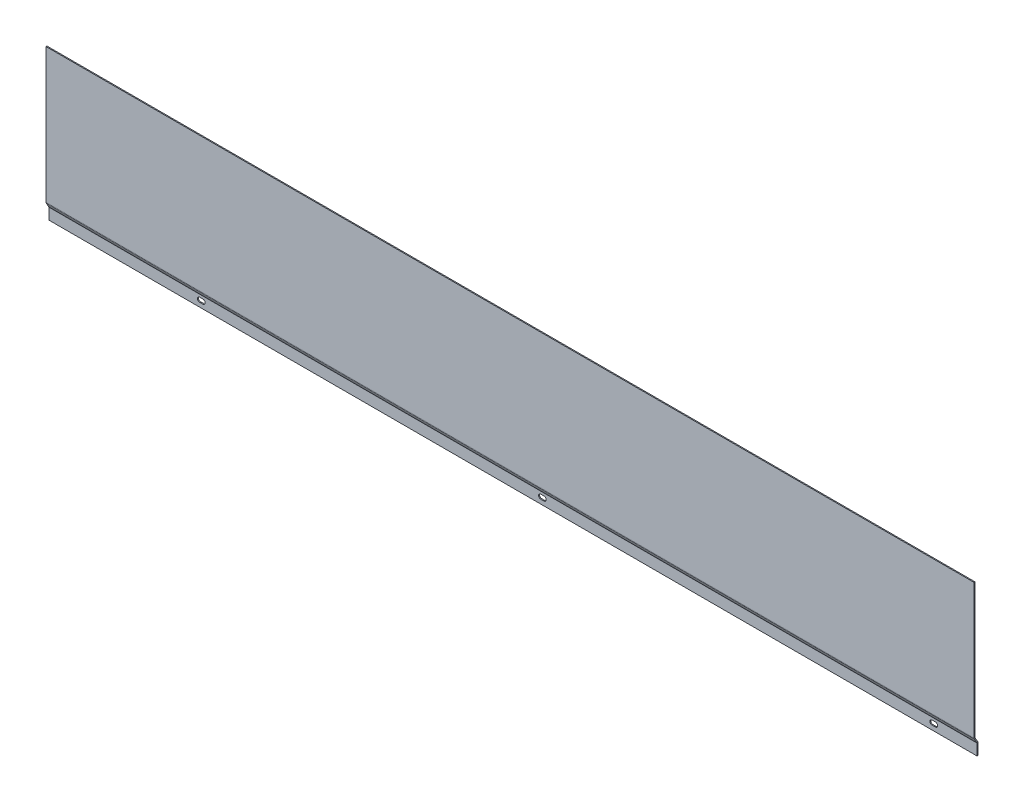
ISO-10303-21;
HEADER;
FILE_DESCRIPTION(('STEP AP214'),'2;1');
FILE_NAME('part.step','',(''),(''),'','','');
FILE_SCHEMA(('AUTOMOTIVE_DESIGN { 1 0 10303 214 1 1 1 1 }'));
ENDSEC;
DATA;
#1=APPLICATION_CONTEXT('core data for automotive mechanical design processes');
#2=APPLICATION_PROTOCOL_DEFINITION('international standard','automotive_design',2000,#1);
#3=PRODUCT_CONTEXT('',#1,'mechanical');
#4=PRODUCT('Part','Part','',(#3));
#5=PRODUCT_RELATED_PRODUCT_CATEGORY('part','',(#4));
#6=PRODUCT_DEFINITION_FORMATION('','',#4);
#7=PRODUCT_DEFINITION_CONTEXT('part definition',#1,'design');
#8=PRODUCT_DEFINITION('design','',#6,#7);
#9=PRODUCT_DEFINITION_SHAPE('','',#8);
#10=(LENGTH_UNIT() NAMED_UNIT(*) SI_UNIT(.MILLI.,.METRE.));
#11=(NAMED_UNIT(*) PLANE_ANGLE_UNIT() SI_UNIT($,.RADIAN.));
#12=(NAMED_UNIT(*) SI_UNIT($,.STERADIAN.) SOLID_ANGLE_UNIT());
#13=UNCERTAINTY_MEASURE_WITH_UNIT(LENGTH_MEASURE(1.E-05),#10,'distance_accuracy_value','');
#14=(GEOMETRIC_REPRESENTATION_CONTEXT(3) GLOBAL_UNCERTAINTY_ASSIGNED_CONTEXT((#13)) GLOBAL_UNIT_ASSIGNED_CONTEXT((#10,
#11,#12)) REPRESENTATION_CONTEXT('',''));
#15=CARTESIAN_POINT('',(0.,0.,0.));
#16=DIRECTION('',(0.,0.,1.));
#17=DIRECTION('',(1.,0.,0.));
#18=AXIS2_PLACEMENT_3D('',#15,#16,#17);
#19=CARTESIAN_POINT('',(1437.,17.1961524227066,0.));
#20=DIRECTION('',(1.,0.,0.));
#21=DIRECTION('',(0.,0.,-1.));
#22=AXIS2_PLACEMENT_3D('',#19,#20,#21);
#23=PLANE('',#22);
#24=DIRECTION('',(0.,0.,1.));
#25=VECTOR('',#24,1.);
#26=CARTESIAN_POINT('',(1437.,17.1961524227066,0.));
#27=LINE('',#26,#25);
#28=CARTESIAN_POINT('',(1437.,17.1961524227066,0.));
#29=VERTEX_POINT('',#28);
#30=CARTESIAN_POINT('',(1437.,17.1961524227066,1.5));
#31=VERTEX_POINT('',#30);
#32=EDGE_CURVE('E11',#29,#31,#27,.T.);
#33=ORIENTED_EDGE('',*,*,#32,.F.);
#34=CARTESIAN_POINT('',(1437.,17.1961524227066,3.));
#35=DIRECTION('',(-1.,0.,0.));
#36=DIRECTION('',(0.,0.,1.));
#37=AXIS2_PLACEMENT_3D('',#34,#35,#36);
#38=CIRCLE('',#37,3.);
#39=CARTESIAN_POINT('',(1437.,18.6961524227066,0.401923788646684));
#40=VERTEX_POINT('',#39);
#41=EDGE_CURVE('E416',#29,#40,#38,.F.);
#42=ORIENTED_EDGE('',*,*,#41,.T.);
#43=DIRECTION('',(0.,0.5,-0.866025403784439));
#44=VECTOR('',#43,1.);
#45=CARTESIAN_POINT('',(1437.,17.9461524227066,1.70096189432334));
#46=LINE('',#45,#44);
#47=CARTESIAN_POINT('',(1437.,17.9461524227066,1.70096189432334));
#48=VERTEX_POINT('',#47);
#49=EDGE_CURVE('E46',#48,#40,#46,.T.);
#50=ORIENTED_EDGE('',*,*,#49,.F.);
#51=CARTESIAN_POINT('',(1437.,17.1961524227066,3.));
#52=DIRECTION('',(1.,0.,0.));
#53=DIRECTION('',(0.,0.,-1.));
#54=AXIS2_PLACEMENT_3D('',#51,#52,#53);
#55=CIRCLE('',#54,1.5);
#56=EDGE_CURVE('E400',#31,#48,#55,.T.);
#57=ORIENTED_EDGE('',*,*,#56,.F.);
#58=EDGE_LOOP('',(#33,#42,#50,#57));
#59=FACE_BOUND('',#58,.T.);
#60=ADVANCED_FACE('F38',(#59),#23,.T.);
#61=CARTESIAN_POINT('',(1437.,17.9461524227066,1.70096189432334));
#62=DIRECTION('',(1.,0.,0.));
#63=DIRECTION('',(0.,0.,-1.));
#64=AXIS2_PLACEMENT_3D('',#61,#62,#63);
#65=PLANE('',#64);
#66=DIRECTION('',(0.,1.,0.));
#67=VECTOR('',#66,1.);
#68=CARTESIAN_POINT('',(1437.,0.,0.));
#69=LINE('',#68,#67);
#70=CARTESIAN_POINT('',(1437.,0.,0.));
#71=VERTEX_POINT('',#70);
#72=EDGE_CURVE('E412',#71,#29,#69,.T.);
#73=ORIENTED_EDGE('',*,*,#72,.T.);
#74=ORIENTED_EDGE('',*,*,#32,.T.);
#75=DIRECTION('',(0.,1.,0.));
#76=VECTOR('',#75,1.);
#77=CARTESIAN_POINT('',(1437.,0.,1.5));
#78=LINE('',#77,#76);
#79=CARTESIAN_POINT('',(1437.,0.,1.5));
#80=VERTEX_POINT('',#79);
#81=EDGE_CURVE('E404',#80,#31,#78,.T.);
#82=ORIENTED_EDGE('',*,*,#81,.F.);
#83=DIRECTION('',(0.,0.,1.));
#84=VECTOR('',#83,1.);
#85=CARTESIAN_POINT('',(1437.,0.,0.));
#86=LINE('',#85,#84);
#87=EDGE_CURVE('E408',#71,#80,#86,.T.);
#88=ORIENTED_EDGE('',*,*,#87,.F.);
#89=EDGE_LOOP('',(#73,#74,#82,#88));
#90=FACE_BOUND('',#89,.T.);
#91=ADVANCED_FACE('F532',(#90),#65,.T.);
#92=CARTESIAN_POINT('',(0.,18.6961524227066,0.401923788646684));
#93=DIRECTION('',(-1.,0.,0.));
#94=DIRECTION('',(0.,0.,1.));
#95=AXIS2_PLACEMENT_3D('',#92,#93,#94);
#96=PLANE('',#95);
#97=DIRECTION('',(0.,-0.5,0.866025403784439));
#98=VECTOR('',#97,1.);
#99=CARTESIAN_POINT('',(0.,18.6961524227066,0.401923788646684));
#100=LINE('',#99,#98);
#101=CARTESIAN_POINT('',(0.,18.6961524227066,0.401923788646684));
#102=VERTEX_POINT('',#101);
#103=CARTESIAN_POINT('',(0.,17.9461524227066,1.70096189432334));
#104=VERTEX_POINT('',#103);
#105=EDGE_CURVE('E487',#102,#104,#100,.T.);
#106=ORIENTED_EDGE('',*,*,#105,.F.);
#107=CARTESIAN_POINT('',(0.,17.1961524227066,3.));
#108=DIRECTION('',(-1.,0.,0.));
#109=DIRECTION('',(0.,0.,1.));
#110=AXIS2_PLACEMENT_3D('',#107,#108,#109);
#111=CIRCLE('',#110,3.);
#112=CARTESIAN_POINT('',(0.,17.1961524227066,0.));
#113=VERTEX_POINT('',#112);
#114=EDGE_CURVE('E369',#113,#102,#111,.F.);
#115=ORIENTED_EDGE('',*,*,#114,.F.);
#116=DIRECTION('',(0.,0.,-1.));
#117=VECTOR('',#116,1.);
#118=CARTESIAN_POINT('',(0.,17.1961524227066,1.5));
#119=LINE('',#118,#117);
#120=CARTESIAN_POINT('',(0.,17.1961524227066,1.5));
#121=VERTEX_POINT('',#120);
#122=EDGE_CURVE('E484',#121,#113,#119,.T.);
#123=ORIENTED_EDGE('',*,*,#122,.F.);
#124=CARTESIAN_POINT('',(0.,17.1961524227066,3.));
#125=DIRECTION('',(1.,0.,0.));
#126=DIRECTION('',(0.,0.,-1.));
#127=AXIS2_PLACEMENT_3D('',#124,#125,#126);
#128=CIRCLE('',#127,1.5);
#129=EDGE_CURVE('E353',#121,#104,#128,.T.);
#130=ORIENTED_EDGE('',*,*,#129,.T.);
#131=EDGE_LOOP('',(#106,#115,#123,#130));
#132=FACE_BOUND('',#131,.T.);
#133=ADVANCED_FACE('F542',(#132),#96,.T.);
#134=CARTESIAN_POINT('',(0.,17.1961524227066,1.5));
#135=DIRECTION('',(-1.,0.,0.));
#136=DIRECTION('',(0.,0.,1.));
#137=AXIS2_PLACEMENT_3D('',#134,#135,#136);
#138=PLANE('',#137);
#139=DIRECTION('',(0.,0.866025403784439,0.5));
#140=VECTOR('',#139,1.);
#141=CARTESIAN_POINT('',(0.,18.,0.));
#142=LINE('',#141,#140);
#143=CARTESIAN_POINT('',(0.,25.4461524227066,4.29903810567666));
#144=VERTEX_POINT('',#143);
#145=EDGE_CURVE('E373',#102,#144,#142,.T.);
#146=ORIENTED_EDGE('',*,*,#145,.F.);
#147=ORIENTED_EDGE('',*,*,#105,.T.);
#148=DIRECTION('',(0.,0.866025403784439,0.5));
#149=VECTOR('',#148,1.);
#150=CARTESIAN_POINT('',(0.,17.25,1.29903810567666));
#151=LINE('',#150,#149);
#152=CARTESIAN_POINT('',(0.,24.6961524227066,5.59807621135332));
#153=VERTEX_POINT('',#152);
#154=EDGE_CURVE('E349',#104,#153,#151,.T.);
#155=ORIENTED_EDGE('',*,*,#154,.T.);
#156=DIRECTION('',(0.,0.5,-0.866025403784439));
#157=VECTOR('',#156,1.);
#158=CARTESIAN_POINT('',(0.,24.6961524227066,5.59807621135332));
#159=LINE('',#158,#157);
#160=EDGE_CURVE('E472',#153,#144,#159,.T.);
#161=ORIENTED_EDGE('',*,*,#160,.T.);
#162=EDGE_LOOP('',(#146,#147,#155,#161));
#163=FACE_BOUND('',#162,.T.);
#164=ADVANCED_FACE('F544',(#163),#138,.T.);
#165=CARTESIAN_POINT('',(1437.,25.4461524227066,4.29903810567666));
#166=DIRECTION('',(1.,0.,0.));
#167=DIRECTION('',(0.,0.,-1.));
#168=AXIS2_PLACEMENT_3D('',#165,#166,#167);
#169=PLANE('',#168);
#170=DIRECTION('',(0.,-0.5,0.866025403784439));
#171=VECTOR('',#170,1.);
#172=CARTESIAN_POINT('',(1437.,25.4461524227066,4.29903810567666));
#173=LINE('',#172,#171);
#174=CARTESIAN_POINT('',(1437.,25.4461524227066,4.29903810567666));
#175=VERTEX_POINT('',#174);
#176=CARTESIAN_POINT('',(1437.,24.6961524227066,5.59807621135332));
#177=VERTEX_POINT('',#176);
#178=EDGE_CURVE('E481',#175,#177,#173,.T.);
#179=ORIENTED_EDGE('',*,*,#178,.F.);
#180=CARTESIAN_POINT('',(1437.,26.1961524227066,3.));
#181=DIRECTION('',(1.,0.,0.));
#182=DIRECTION('',(0.,0.,-1.));
#183=AXIS2_PLACEMENT_3D('',#180,#181,#182);
#184=CIRCLE('',#183,1.5);
#185=CARTESIAN_POINT('',(1437.,26.1961524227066,4.5));
#186=VERTEX_POINT('',#185);
#187=EDGE_CURVE('E424',#175,#186,#184,.F.);
#188=ORIENTED_EDGE('',*,*,#187,.T.);
#189=DIRECTION('',(0.,0.,-1.));
#190=VECTOR('',#189,1.);
#191=CARTESIAN_POINT('',(1437.,26.1961524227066,6.));
#192=LINE('',#191,#190);
#193=CARTESIAN_POINT('',(1437.,26.1961524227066,6.));
#194=VERTEX_POINT('',#193);
#195=EDGE_CURVE('E478',#194,#186,#192,.T.);
#196=ORIENTED_EDGE('',*,*,#195,.F.);
#197=CARTESIAN_POINT('',(1437.,26.1961524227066,3.));
#198=DIRECTION('',(1.,0.,0.));
#199=DIRECTION('',(0.,0.,-1.));
#200=AXIS2_PLACEMENT_3D('',#197,#198,#199);
#201=CIRCLE('',#200,3.);
#202=EDGE_CURVE('E392',#177,#194,#201,.F.);
#203=ORIENTED_EDGE('',*,*,#202,.F.);
#204=EDGE_LOOP('',(#179,#188,#196,#203));
#205=FACE_BOUND('',#204,.T.);
#206=ADVANCED_FACE('F513',(#205),#169,.T.);
#207=CARTESIAN_POINT('',(1437.,26.1961524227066,6.));
#208=DIRECTION('',(1.,0.,0.));
#209=DIRECTION('',(0.,0.,-1.));
#210=AXIS2_PLACEMENT_3D('',#207,#208,#209);
#211=PLANE('',#210);
#212=DIRECTION('',(0.,0.866025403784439,0.5));
#213=VECTOR('',#212,1.);
#214=CARTESIAN_POINT('',(1437.,18.,0.));
#215=LINE('',#214,#213);
#216=EDGE_CURVE('E420',#40,#175,#215,.T.);
#217=ORIENTED_EDGE('',*,*,#216,.T.);
#218=ORIENTED_EDGE('',*,*,#178,.T.);
#219=DIRECTION('',(0.,0.866025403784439,0.5));
#220=VECTOR('',#219,1.);
#221=CARTESIAN_POINT('',(1437.,17.25,1.29903810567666));
#222=LINE('',#221,#220);
#223=EDGE_CURVE('E396',#48,#177,#222,.T.);
#224=ORIENTED_EDGE('',*,*,#223,.F.);
#225=ORIENTED_EDGE('',*,*,#49,.T.);
#226=EDGE_LOOP('',(#217,#218,#224,#225));
#227=FACE_BOUND('',#226,.T.);
#228=ADVANCED_FACE('F492',(#227),#211,.T.);
#229=CARTESIAN_POINT('',(0.,26.1961524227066,4.5));
#230=DIRECTION('',(-1.,0.,0.));
#231=DIRECTION('',(0.,0.,1.));
#232=AXIS2_PLACEMENT_3D('',#229,#230,#231);
#233=PLANE('',#232);
#234=DIRECTION('',(0.,0.,1.));
#235=VECTOR('',#234,1.);
#236=CARTESIAN_POINT('',(0.,26.1961524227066,4.5));
#237=LINE('',#236,#235);
#238=CARTESIAN_POINT('',(0.,26.1961524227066,4.5));
#239=VERTEX_POINT('',#238);
#240=CARTESIAN_POINT('',(0.,26.1961524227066,6.));
#241=VERTEX_POINT('',#240);
#242=EDGE_CURVE('E475',#239,#241,#237,.T.);
#243=ORIENTED_EDGE('',*,*,#242,.F.);
#244=CARTESIAN_POINT('',(0.,26.1961524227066,3.));
#245=DIRECTION('',(1.,0.,0.));
#246=DIRECTION('',(0.,0.,-1.));
#247=AXIS2_PLACEMENT_3D('',#244,#245,#246);
#248=CIRCLE('',#247,1.5);
#249=EDGE_CURVE('E377',#144,#239,#248,.F.);
#250=ORIENTED_EDGE('',*,*,#249,.F.);
#251=ORIENTED_EDGE('',*,*,#160,.F.);
#252=CARTESIAN_POINT('',(0.,26.1961524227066,3.));
#253=DIRECTION('',(1.,0.,0.));
#254=DIRECTION('',(0.,0.,-1.));
#255=AXIS2_PLACEMENT_3D('',#252,#253,#254);
#256=CIRCLE('',#255,3.);
#257=EDGE_CURVE('E345',#153,#241,#256,.F.);
#258=ORIENTED_EDGE('',*,*,#257,.T.);
#259=EDGE_LOOP('',(#243,#250,#251,#258));
#260=FACE_BOUND('',#259,.T.);
#261=ADVANCED_FACE('F546',(#260),#233,.T.);
#262=CARTESIAN_POINT('',(0.,24.6961524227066,5.59807621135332));
#263=DIRECTION('',(-1.,0.,0.));
#264=DIRECTION('',(0.,0.,1.));
#265=AXIS2_PLACEMENT_3D('',#262,#263,#264);
#266=PLANE('',#265);
#267=DIRECTION('',(0.,1.,0.));
#268=VECTOR('',#267,1.);
#269=CARTESIAN_POINT('',(0.,25.7942286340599,4.5));
#270=LINE('',#269,#268);
#271=CARTESIAN_POINT('',(0.,235.,4.5));
#272=VERTEX_POINT('',#271);
#273=EDGE_CURVE('E324',#239,#272,#270,.T.);
#274=ORIENTED_EDGE('',*,*,#273,.F.);
#275=ORIENTED_EDGE('',*,*,#242,.T.);
#276=DIRECTION('',(0.,1.,0.));
#277=VECTOR('',#276,1.);
#278=CARTESIAN_POINT('',(0.,25.7942286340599,6.));
#279=LINE('',#278,#277);
#280=CARTESIAN_POINT('',(0.,235.,6.));
#281=VERTEX_POINT('',#280);
#282=EDGE_CURVE('E341',#241,#281,#279,.T.);
#283=ORIENTED_EDGE('',*,*,#282,.T.);
#284=DIRECTION('',(0.,0.,-1.));
#285=VECTOR('',#284,1.);
#286=CARTESIAN_POINT('',(0.,235.,6.));
#287=LINE('',#286,#285);
#288=EDGE_CURVE('E337',#281,#272,#287,.T.);
#289=ORIENTED_EDGE('',*,*,#288,.T.);
#290=EDGE_LOOP('',(#274,#275,#283,#289));
#291=FACE_BOUND('',#290,.T.);
#292=ADVANCED_FACE('F552',(#291),#266,.T.);
#293=CARTESIAN_POINT('',(1437.,25.7942286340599,4.5));
#294=DIRECTION('',(0.,0.,1.));
#295=DIRECTION('',(1.,0.,0.));
#296=AXIS2_PLACEMENT_3D('',#293,#294,#295);
#297=PLANE('',#296);
#298=ORIENTED_EDGE('',*,*,#273,.T.);
#299=DIRECTION('',(-1.,0.,0.));
#300=VECTOR('',#299,1.);
#301=CARTESIAN_POINT('',(1437.,235.,4.5));
#302=LINE('',#301,#300);
#303=CARTESIAN_POINT('',(1437.,235.,4.5));
#304=VERTEX_POINT('',#303);
#305=EDGE_CURVE('E469',#304,#272,#302,.T.);
#306=ORIENTED_EDGE('',*,*,#305,.F.);
#307=DIRECTION('',(0.,1.,0.));
#308=VECTOR('',#307,1.);
#309=CARTESIAN_POINT('',(1437.,25.7942286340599,4.5));
#310=LINE('',#309,#308);
#311=EDGE_CURVE('E381',#186,#304,#310,.T.);
#312=ORIENTED_EDGE('',*,*,#311,.F.);
#313=DIRECTION('',(-1.,0.,0.));
#314=VECTOR('',#313,1.);
#315=CARTESIAN_POINT('',(1437.,26.1961524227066,4.5));
#316=LINE('',#315,#314);
#317=EDGE_CURVE('E428',#186,#239,#316,.T.);
#318=ORIENTED_EDGE('',*,*,#317,.T.);
#319=EDGE_LOOP('',(#298,#306,#312,#318));
#320=FACE_BOUND('',#319,.T.);
#321=ADVANCED_FACE('F549',(#320),#297,.F.);
#322=CARTESIAN_POINT('',(1437.,235.,6.));
#323=DIRECTION('',(0.,1.,0.));
#324=DIRECTION('',(0.,0.,1.));
#325=AXIS2_PLACEMENT_3D('',#322,#323,#324);
#326=PLANE('',#325);
#327=ORIENTED_EDGE('',*,*,#288,.F.);
#328=DIRECTION('',(-1.,0.,0.));
#329=VECTOR('',#328,1.);
#330=CARTESIAN_POINT('',(1437.,235.,6.));
#331=LINE('',#330,#329);
#332=CARTESIAN_POINT('',(1437.,235.,6.));
#333=VERTEX_POINT('',#332);
#334=EDGE_CURVE('E466',#333,#281,#331,.T.);
#335=ORIENTED_EDGE('',*,*,#334,.F.);
#336=DIRECTION('',(0.,0.,-1.));
#337=VECTOR('',#336,1.);
#338=CARTESIAN_POINT('',(1437.,235.,6.));
#339=LINE('',#338,#337);
#340=EDGE_CURVE('E384',#333,#304,#339,.T.);
#341=ORIENTED_EDGE('',*,*,#340,.T.);
#342=ORIENTED_EDGE('',*,*,#305,.T.);
#343=EDGE_LOOP('',(#327,#335,#341,#342));
#344=FACE_BOUND('',#343,.T.);
#345=ADVANCED_FACE('F556',(#344),#326,.T.);
#346=CARTESIAN_POINT('',(1437.,25.7942286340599,6.));
#347=DIRECTION('',(0.,0.,1.));
#348=DIRECTION('',(1.,0.,0.));
#349=AXIS2_PLACEMENT_3D('',#346,#347,#348);
#350=PLANE('',#349);
#351=ORIENTED_EDGE('',*,*,#282,.F.);
#352=DIRECTION('',(-1.,0.,0.));
#353=VECTOR('',#352,1.);
#354=CARTESIAN_POINT('',(1437.,26.1961524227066,6.));
#355=LINE('',#354,#353);
#356=EDGE_CURVE('E462',#194,#241,#355,.T.);
#357=ORIENTED_EDGE('',*,*,#356,.F.);
#358=DIRECTION('',(0.,1.,0.));
#359=VECTOR('',#358,1.);
#360=CARTESIAN_POINT('',(1437.,25.7942286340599,6.));
#361=LINE('',#360,#359);
#362=EDGE_CURVE('E388',#194,#333,#361,.T.);
#363=ORIENTED_EDGE('',*,*,#362,.T.);
#364=ORIENTED_EDGE('',*,*,#334,.T.);
#365=EDGE_LOOP('',(#351,#357,#363,#364));
#366=FACE_BOUND('',#365,.T.);
#367=ADVANCED_FACE('F562',(#366),#350,.T.);
#368=CARTESIAN_POINT('',(1437.,26.1961524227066,3.));
#369=DIRECTION('',(-1.,0.,0.));
#370=DIRECTION('',(0.,0.,1.));
#371=AXIS2_PLACEMENT_3D('',#368,#369,#370);
#372=CYLINDRICAL_SURFACE('',#371,3.);
#373=ORIENTED_EDGE('',*,*,#257,.F.);
#374=DIRECTION('',(-1.,0.,0.));
#375=VECTOR('',#374,1.);
#376=CARTESIAN_POINT('',(1437.,24.6961524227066,5.59807621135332));
#377=LINE('',#376,#375);
#378=EDGE_CURVE('E458',#177,#153,#377,.T.);
#379=ORIENTED_EDGE('',*,*,#378,.F.);
#380=ORIENTED_EDGE('',*,*,#202,.T.);
#381=ORIENTED_EDGE('',*,*,#356,.T.);
#382=EDGE_LOOP('',(#373,#379,#380,#381));
#383=FACE_BOUND('',#382,.T.);
#384=ADVANCED_FACE('F519',(#383),#372,.T.);
#385=CARTESIAN_POINT('',(1437.,17.25,1.29903810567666));
#386=DIRECTION('',(0.,-0.5,0.866025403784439));
#387=DIRECTION('',(0.,-0.866025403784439,-0.5));
#388=AXIS2_PLACEMENT_3D('',#385,#386,#387);
#389=PLANE('',#388);
#390=ORIENTED_EDGE('',*,*,#154,.F.);
#391=DIRECTION('',(-1.,0.,0.));
#392=VECTOR('',#391,1.);
#393=CARTESIAN_POINT('',(1437.,17.9461524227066,1.70096189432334));
#394=LINE('',#393,#392);
#395=EDGE_CURVE('E454',#48,#104,#394,.T.);
#396=ORIENTED_EDGE('',*,*,#395,.F.);
#397=ORIENTED_EDGE('',*,*,#223,.T.);
#398=ORIENTED_EDGE('',*,*,#378,.T.);
#399=EDGE_LOOP('',(#390,#396,#397,#398));
#400=FACE_BOUND('',#399,.T.);
#401=ADVANCED_FACE('F522',(#400),#389,.T.);
#402=CARTESIAN_POINT('',(1437.,17.1961524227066,3.));
#403=DIRECTION('',(-1.,0.,0.));
#404=DIRECTION('',(0.,0.,1.));
#405=AXIS2_PLACEMENT_3D('',#402,#403,#404);
#406=CYLINDRICAL_SURFACE('',#405,1.5);
#407=ORIENTED_EDGE('',*,*,#129,.F.);
#408=DIRECTION('',(-1.,0.,0.));
#409=VECTOR('',#408,1.);
#410=CARTESIAN_POINT('',(1437.,17.1961524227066,1.5));
#411=LINE('',#410,#409);
#412=EDGE_CURVE('E450',#31,#121,#411,.T.);
#413=ORIENTED_EDGE('',*,*,#412,.F.);
#414=ORIENTED_EDGE('',*,*,#56,.T.);
#415=ORIENTED_EDGE('',*,*,#395,.T.);
#416=EDGE_LOOP('',(#407,#413,#414,#415));
#417=FACE_BOUND('',#416,.T.);
#418=ADVANCED_FACE('F525',(#417),#406,.F.);
#419=CARTESIAN_POINT('',(1437.,0.,1.5));
#420=DIRECTION('',(0.,0.,1.));
#421=DIRECTION('',(1.,0.,0.));
#422=AXIS2_PLACEMENT_3D('',#419,#420,#421);
#423=PLANE('',#422);
#424=CARTESIAN_POINT('',(761.4,10.,1.5));
#425=DIRECTION('',(0.,0.,1.));
#426=DIRECTION('',(-1.,0.,0.));
#427=AXIS2_PLACEMENT_3D('',#424,#425,#426);
#428=CIRCLE('',#427,3.4);
#429=CARTESIAN_POINT('',(761.4,13.4,1.5));
#430=VERTEX_POINT('',#429);
#431=CARTESIAN_POINT('',(761.4,6.6,1.5));
#432=VERTEX_POINT('',#431);
#433=EDGE_CURVE('E53',#430,#432,#428,.T.);
#434=ORIENTED_EDGE('',*,*,#433,.F.);
#435=DIRECTION('',(-1.,0.,0.));
#436=VECTOR('',#435,1.);
#437=CARTESIAN_POINT('',(761.4,13.4,1.5));
#438=LINE('',#437,#436);
#439=CARTESIAN_POINT('',(766.6,13.4,1.5));
#440=VERTEX_POINT('',#439);
#441=EDGE_CURVE('E218',#440,#430,#438,.T.);
#442=ORIENTED_EDGE('',*,*,#441,.F.);
#443=CARTESIAN_POINT('',(766.6,10.,1.5));
#444=DIRECTION('',(0.,0.,1.));
#445=DIRECTION('',(1.,0.,0.));
#446=AXIS2_PLACEMENT_3D('',#443,#444,#445);
#447=CIRCLE('',#446,3.4);
#448=CARTESIAN_POINT('',(766.6,6.6,1.5));
#449=VERTEX_POINT('',#448);
#450=EDGE_CURVE('E200',#449,#440,#447,.T.);
#451=ORIENTED_EDGE('',*,*,#450,.F.);
#452=DIRECTION('',(1.,0.,0.));
#453=VECTOR('',#452,1.);
#454=CARTESIAN_POINT('',(761.4,6.6,1.5));
#455=LINE('',#454,#453);
#456=EDGE_CURVE('E210',#432,#449,#455,.T.);
#457=ORIENTED_EDGE('',*,*,#456,.F.);
#458=EDGE_LOOP('',(#434,#442,#451,#457));
#459=FACE_BOUND('',#458,.T.);
#460=CARTESIAN_POINT('',(233.4,10.,1.5));
#461=DIRECTION('',(0.,0.,1.));
#462=DIRECTION('',(-1.,0.,0.));
#463=AXIS2_PLACEMENT_3D('',#460,#461,#462);
#464=CIRCLE('',#463,3.4);
#465=CARTESIAN_POINT('',(233.4,13.4,1.5));
#466=VERTEX_POINT('',#465);
#467=CARTESIAN_POINT('',(233.4,6.6,1.5));
#468=VERTEX_POINT('',#467);
#469=EDGE_CURVE('E242',#466,#468,#464,.T.);
#470=ORIENTED_EDGE('',*,*,#469,.F.);
#471=DIRECTION('',(-1.,0.,0.));
#472=VECTOR('',#471,1.);
#473=CARTESIAN_POINT('',(233.4,13.4,1.5));
#474=LINE('',#473,#472);
#475=CARTESIAN_POINT('',(238.6,13.4,1.5));
#476=VERTEX_POINT('',#475);
#477=EDGE_CURVE('E257',#476,#466,#474,.T.);
#478=ORIENTED_EDGE('',*,*,#477,.F.);
#479=CARTESIAN_POINT('',(238.6,10.,1.5));
#480=DIRECTION('',(0.,0.,1.));
#481=DIRECTION('',(1.,0.,0.));
#482=AXIS2_PLACEMENT_3D('',#479,#480,#481);
#483=CIRCLE('',#482,3.4);
#484=CARTESIAN_POINT('',(238.6,6.6,1.5));
#485=VERTEX_POINT('',#484);
#486=EDGE_CURVE('E253',#485,#476,#483,.T.);
#487=ORIENTED_EDGE('',*,*,#486,.F.);
#488=DIRECTION('',(1.,0.,0.));
#489=VECTOR('',#488,1.);
#490=CARTESIAN_POINT('',(233.4,6.6,1.5));
#491=LINE('',#490,#489);
#492=EDGE_CURVE('E249',#468,#485,#491,.T.);
#493=ORIENTED_EDGE('',*,*,#492,.F.);
#494=EDGE_LOOP('',(#470,#478,#487,#493));
#495=FACE_BOUND('',#494,.T.);
#496=CARTESIAN_POINT('',(1367.4,10.,1.5));
#497=DIRECTION('',(0.,0.,1.));
#498=DIRECTION('',(-1.,0.,0.));
#499=AXIS2_PLACEMENT_3D('',#496,#497,#498);
#500=CIRCLE('',#499,3.4);
#501=CARTESIAN_POINT('',(1367.4,13.4,1.5));
#502=VERTEX_POINT('',#501);
#503=CARTESIAN_POINT('',(1367.4,6.6,1.5));
#504=VERTEX_POINT('',#503);
#505=EDGE_CURVE('E280',#502,#504,#500,.T.);
#506=ORIENTED_EDGE('',*,*,#505,.F.);
#507=DIRECTION('',(-1.,0.,0.));
#508=VECTOR('',#507,1.);
#509=CARTESIAN_POINT('',(1367.4,13.4,1.5));
#510=LINE('',#509,#508);
#511=CARTESIAN_POINT('',(1372.6,13.4,1.5));
#512=VERTEX_POINT('',#511);
#513=EDGE_CURVE('E300',#512,#502,#510,.T.);
#514=ORIENTED_EDGE('',*,*,#513,.F.);
#515=CARTESIAN_POINT('',(1372.6,10.,1.5));
#516=DIRECTION('',(0.,0.,1.));
#517=DIRECTION('',(1.,0.,0.));
#518=AXIS2_PLACEMENT_3D('',#515,#516,#517);
#519=CIRCLE('',#518,3.4);
#520=CARTESIAN_POINT('',(1372.6,6.6,1.5));
#521=VERTEX_POINT('',#520);
#522=EDGE_CURVE('E296',#521,#512,#519,.T.);
#523=ORIENTED_EDGE('',*,*,#522,.F.);
#524=DIRECTION('',(1.,0.,0.));
#525=VECTOR('',#524,1.);
#526=CARTESIAN_POINT('',(1367.4,6.6,1.5));
#527=LINE('',#526,#525);
#528=EDGE_CURVE('E292',#504,#521,#527,.T.);
#529=ORIENTED_EDGE('',*,*,#528,.F.);
#530=EDGE_LOOP('',(#506,#514,#523,#529));
#531=FACE_BOUND('',#530,.T.);
#532=DIRECTION('',(0.,1.,0.));
#533=VECTOR('',#532,1.);
#534=CARTESIAN_POINT('',(0.,0.,1.5));
#535=LINE('',#534,#533);
#536=CARTESIAN_POINT('',(0.,0.,1.5));
#537=VERTEX_POINT('',#536);
#538=EDGE_CURVE('E357',#537,#121,#535,.T.);
#539=ORIENTED_EDGE('',*,*,#538,.F.);
#540=DIRECTION('',(-1.,0.,0.));
#541=VECTOR('',#540,1.);
#542=CARTESIAN_POINT('',(1437.,0.,1.5));
#543=LINE('',#542,#541);
#544=EDGE_CURVE('E447',#80,#537,#543,.T.);
#545=ORIENTED_EDGE('',*,*,#544,.F.);
#546=ORIENTED_EDGE('',*,*,#81,.T.);
#547=ORIENTED_EDGE('',*,*,#412,.T.);
#548=EDGE_LOOP('',(#539,#545,#546,#547));
#549=FACE_BOUND('',#548,.T.);
#550=ADVANCED_FACE('F215',(#459,#495,#531,#549),#423,.T.);
#551=CARTESIAN_POINT('',(1437.,0.,0.));
#552=DIRECTION('',(0.,-1.,0.));
#553=DIRECTION('',(0.,0.,-1.));
#554=AXIS2_PLACEMENT_3D('',#551,#552,#553);
#555=PLANE('',#554);
#556=DIRECTION('',(0.,0.,1.));
#557=VECTOR('',#556,1.);
#558=CARTESIAN_POINT('',(0.,0.,0.));
#559=LINE('',#558,#557);
#560=CARTESIAN_POINT('',(0.,0.,0.));
#561=VERTEX_POINT('',#560);
#562=EDGE_CURVE('E361',#561,#537,#559,.T.);
#563=ORIENTED_EDGE('',*,*,#562,.F.);
#564=DIRECTION('',(-1.,0.,0.));
#565=VECTOR('',#564,1.);
#566=CARTESIAN_POINT('',(1437.,0.,0.));
#567=LINE('',#566,#565);
#568=EDGE_CURVE('E444',#71,#561,#567,.T.);
#569=ORIENTED_EDGE('',*,*,#568,.F.);
#570=ORIENTED_EDGE('',*,*,#87,.T.);
#571=ORIENTED_EDGE('',*,*,#544,.T.);
#572=EDGE_LOOP('',(#563,#569,#570,#571));
#573=FACE_BOUND('',#572,.T.);
#574=ADVANCED_FACE('F535',(#573),#555,.T.);
#575=CARTESIAN_POINT('',(1437.,0.,0.));
#576=DIRECTION('',(0.,0.,1.));
#577=DIRECTION('',(1.,0.,0.));
#578=AXIS2_PLACEMENT_3D('',#575,#576,#577);
#579=PLANE('',#578);
#580=DIRECTION('',(-1.,0.,0.));
#581=VECTOR('',#580,1.);
#582=CARTESIAN_POINT('',(761.4,13.4,0.));
#583=LINE('',#582,#581);
#584=CARTESIAN_POINT('',(766.6,13.4,0.));
#585=VERTEX_POINT('',#584);
#586=CARTESIAN_POINT('',(761.4,13.4,0.));
#587=VERTEX_POINT('',#586);
#588=EDGE_CURVE('E235',#585,#587,#583,.T.);
#589=ORIENTED_EDGE('',*,*,#588,.T.);
#590=CARTESIAN_POINT('',(761.4,10.,0.));
#591=DIRECTION('',(0.,0.,1.));
#592=DIRECTION('',(-1.,0.,0.));
#593=AXIS2_PLACEMENT_3D('',#590,#591,#592);
#594=CIRCLE('',#593,3.4);
#595=CARTESIAN_POINT('',(761.4,6.6,0.));
#596=VERTEX_POINT('',#595);
#597=EDGE_CURVE('E223',#587,#596,#594,.T.);
#598=ORIENTED_EDGE('',*,*,#597,.T.);
#599=DIRECTION('',(1.,0.,0.));
#600=VECTOR('',#599,1.);
#601=CARTESIAN_POINT('',(761.4,6.6,0.));
#602=LINE('',#601,#600);
#603=CARTESIAN_POINT('',(766.6,6.6,0.));
#604=VERTEX_POINT('',#603);
#605=EDGE_CURVE('E230',#596,#604,#602,.T.);
#606=ORIENTED_EDGE('',*,*,#605,.T.);
#607=CARTESIAN_POINT('',(766.6,10.,0.));
#608=DIRECTION('',(0.,0.,1.));
#609=DIRECTION('',(1.,0.,0.));
#610=AXIS2_PLACEMENT_3D('',#607,#608,#609);
#611=CIRCLE('',#610,3.4);
#612=EDGE_CURVE('E61',#604,#585,#611,.T.);
#613=ORIENTED_EDGE('',*,*,#612,.T.);
#614=EDGE_LOOP('',(#589,#598,#606,#613));
#615=FACE_BOUND('',#614,.T.);
#616=DIRECTION('',(-1.,0.,0.));
#617=VECTOR('',#616,1.);
#618=CARTESIAN_POINT('',(233.4,13.4,0.));
#619=LINE('',#618,#617);
#620=CARTESIAN_POINT('',(238.6,13.4,0.));
#621=VERTEX_POINT('',#620);
#622=CARTESIAN_POINT('',(233.4,13.4,0.));
#623=VERTEX_POINT('',#622);
#624=EDGE_CURVE('E272',#621,#623,#619,.T.);
#625=ORIENTED_EDGE('',*,*,#624,.T.);
#626=CARTESIAN_POINT('',(233.4,10.,0.));
#627=DIRECTION('',(0.,0.,1.));
#628=DIRECTION('',(-1.,0.,0.));
#629=AXIS2_PLACEMENT_3D('',#626,#627,#628);
#630=CIRCLE('',#629,3.4);
#631=CARTESIAN_POINT('',(233.4,6.6,0.));
#632=VERTEX_POINT('',#631);
#633=EDGE_CURVE('E260',#623,#632,#630,.T.);
#634=ORIENTED_EDGE('',*,*,#633,.T.);
#635=DIRECTION('',(1.,0.,0.));
#636=VECTOR('',#635,1.);
#637=CARTESIAN_POINT('',(233.4,6.6,0.));
#638=LINE('',#637,#636);
#639=CARTESIAN_POINT('',(238.6,6.6,0.));
#640=VERTEX_POINT('',#639);
#641=EDGE_CURVE('E264',#632,#640,#638,.T.);
#642=ORIENTED_EDGE('',*,*,#641,.T.);
#643=CARTESIAN_POINT('',(238.6,10.,0.));
#644=DIRECTION('',(0.,0.,1.));
#645=DIRECTION('',(1.,0.,0.));
#646=AXIS2_PLACEMENT_3D('',#643,#644,#645);
#647=CIRCLE('',#646,3.4);
#648=EDGE_CURVE('E268',#640,#621,#647,.T.);
#649=ORIENTED_EDGE('',*,*,#648,.T.);
#650=EDGE_LOOP('',(#625,#634,#642,#649));
#651=FACE_BOUND('',#650,.T.);
#652=DIRECTION('',(-1.,0.,0.));
#653=VECTOR('',#652,1.);
#654=CARTESIAN_POINT('',(1367.4,13.4,0.));
#655=LINE('',#654,#653);
#656=CARTESIAN_POINT('',(1372.6,13.4,0.));
#657=VERTEX_POINT('',#656);
#658=CARTESIAN_POINT('',(1367.4,13.4,0.));
#659=VERTEX_POINT('',#658);
#660=EDGE_CURVE('E316',#657,#659,#655,.T.);
#661=ORIENTED_EDGE('',*,*,#660,.T.);
#662=CARTESIAN_POINT('',(1367.4,10.,0.));
#663=DIRECTION('',(0.,0.,1.));
#664=DIRECTION('',(-1.,0.,0.));
#665=AXIS2_PLACEMENT_3D('',#662,#663,#664);
#666=CIRCLE('',#665,3.4);
#667=CARTESIAN_POINT('',(1367.4,6.6,0.));
#668=VERTEX_POINT('',#667);
#669=EDGE_CURVE('E304',#659,#668,#666,.T.);
#670=ORIENTED_EDGE('',*,*,#669,.T.);
#671=DIRECTION('',(1.,0.,0.));
#672=VECTOR('',#671,1.);
#673=CARTESIAN_POINT('',(1367.4,6.6,0.));
#674=LINE('',#673,#672);
#675=CARTESIAN_POINT('',(1372.6,6.6,0.));
#676=VERTEX_POINT('',#675);
#677=EDGE_CURVE('E308',#668,#676,#674,.T.);
#678=ORIENTED_EDGE('',*,*,#677,.T.);
#679=CARTESIAN_POINT('',(1372.6,10.,0.));
#680=DIRECTION('',(0.,0.,1.));
#681=DIRECTION('',(1.,0.,0.));
#682=AXIS2_PLACEMENT_3D('',#679,#680,#681);
#683=CIRCLE('',#682,3.4);
#684=EDGE_CURVE('E312',#676,#657,#683,.T.);
#685=ORIENTED_EDGE('',*,*,#684,.T.);
#686=EDGE_LOOP('',(#661,#670,#678,#685));
#687=FACE_BOUND('',#686,.T.);
#688=DIRECTION('',(0.,1.,0.));
#689=VECTOR('',#688,1.);
#690=CARTESIAN_POINT('',(0.,0.,0.));
#691=LINE('',#690,#689);
#692=EDGE_CURVE('E365',#561,#113,#691,.T.);
#693=ORIENTED_EDGE('',*,*,#692,.T.);
#694=DIRECTION('',(-1.,0.,0.));
#695=VECTOR('',#694,1.);
#696=CARTESIAN_POINT('',(1437.,17.1961524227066,0.));
#697=LINE('',#696,#695);
#698=EDGE_CURVE('E440',#29,#113,#697,.T.);
#699=ORIENTED_EDGE('',*,*,#698,.F.);
#700=ORIENTED_EDGE('',*,*,#72,.F.);
#701=ORIENTED_EDGE('',*,*,#568,.T.);
#702=EDGE_LOOP('',(#693,#699,#700,#701));
#703=FACE_BOUND('',#702,.T.);
#704=ADVANCED_FACE('F540',(#615,#651,#687,#703),#579,.F.);
#705=CARTESIAN_POINT('',(1437.,17.1961524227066,3.));
#706=DIRECTION('',(-1.,0.,0.));
#707=DIRECTION('',(0.,0.,1.));
#708=AXIS2_PLACEMENT_3D('',#705,#706,#707);
#709=CYLINDRICAL_SURFACE('',#708,3.);
#710=ORIENTED_EDGE('',*,*,#114,.T.);
#711=DIRECTION('',(-1.,0.,0.));
#712=VECTOR('',#711,1.);
#713=CARTESIAN_POINT('',(1437.,18.6961524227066,0.401923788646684));
#714=LINE('',#713,#712);
#715=EDGE_CURVE('E436',#40,#102,#714,.T.);
#716=ORIENTED_EDGE('',*,*,#715,.F.);
#717=ORIENTED_EDGE('',*,*,#41,.F.);
#718=ORIENTED_EDGE('',*,*,#698,.T.);
#719=EDGE_LOOP('',(#710,#716,#717,#718));
#720=FACE_BOUND('',#719,.T.);
#721=ADVANCED_FACE('F501',(#720),#709,.T.);
#722=CARTESIAN_POINT('',(1437.,18.,0.));
#723=DIRECTION('',(0.,-0.5,0.866025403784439));
#724=DIRECTION('',(0.,-0.866025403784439,-0.5));
#725=AXIS2_PLACEMENT_3D('',#722,#723,#724);
#726=PLANE('',#725);
#727=ORIENTED_EDGE('',*,*,#145,.T.);
#728=DIRECTION('',(-1.,0.,0.));
#729=VECTOR('',#728,1.);
#730=CARTESIAN_POINT('',(1437.,25.4461524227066,4.29903810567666));
#731=LINE('',#730,#729);
#732=EDGE_CURVE('E432',#175,#144,#731,.T.);
#733=ORIENTED_EDGE('',*,*,#732,.F.);
#734=ORIENTED_EDGE('',*,*,#216,.F.);
#735=ORIENTED_EDGE('',*,*,#715,.T.);
#736=EDGE_LOOP('',(#727,#733,#734,#735));
#737=FACE_BOUND('',#736,.T.);
#738=ADVANCED_FACE('F505',(#737),#726,.F.);
#739=CARTESIAN_POINT('',(1437.,26.1961524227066,3.));
#740=DIRECTION('',(-1.,0.,0.));
#741=DIRECTION('',(0.,0.,1.));
#742=AXIS2_PLACEMENT_3D('',#739,#740,#741);
#743=CYLINDRICAL_SURFACE('',#742,1.5);
#744=ORIENTED_EDGE('',*,*,#249,.T.);
#745=ORIENTED_EDGE('',*,*,#317,.F.);
#746=ORIENTED_EDGE('',*,*,#187,.F.);
#747=ORIENTED_EDGE('',*,*,#732,.T.);
#748=EDGE_LOOP('',(#744,#745,#746,#747));
#749=FACE_BOUND('',#748,.T.);
#750=ADVANCED_FACE('F510',(#749),#743,.F.);
#751=CARTESIAN_POINT('',(1437.,26.1961524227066,3.));
#752=DIRECTION('',(1.,0.,0.));
#753=DIRECTION('',(0.,0.,-1.));
#754=AXIS2_PLACEMENT_3D('',#751,#752,#753);
#755=PLANE('',#754);
#756=ORIENTED_EDGE('',*,*,#311,.T.);
#757=ORIENTED_EDGE('',*,*,#340,.F.);
#758=ORIENTED_EDGE('',*,*,#362,.F.);
#759=ORIENTED_EDGE('',*,*,#195,.T.);
#760=EDGE_LOOP('',(#756,#757,#758,#759));
#761=FACE_BOUND('',#760,.T.);
#762=ADVANCED_FACE('F560',(#761),#755,.T.);
#763=CARTESIAN_POINT('',(0.,26.1961524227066,3.));
#764=DIRECTION('',(1.,0.,0.));
#765=DIRECTION('',(0.,0.,-1.));
#766=AXIS2_PLACEMENT_3D('',#763,#764,#765);
#767=PLANE('',#766);
#768=ORIENTED_EDGE('',*,*,#538,.T.);
#769=ORIENTED_EDGE('',*,*,#122,.T.);
#770=ORIENTED_EDGE('',*,*,#692,.F.);
#771=ORIENTED_EDGE('',*,*,#562,.T.);
#772=EDGE_LOOP('',(#768,#769,#770,#771));
#773=FACE_BOUND('',#772,.T.);
#774=ADVANCED_FACE('F672',(#773),#767,.F.);
#775=CARTESIAN_POINT('',(1367.4,10.,0.));
#776=DIRECTION('',(0.,0.,1.));
#777=DIRECTION('',(1.,0.,0.));
#778=AXIS2_PLACEMENT_3D('',#775,#776,#777);
#779=CYLINDRICAL_SURFACE('',#778,3.4);
#780=ORIENTED_EDGE('',*,*,#505,.T.);
#781=DIRECTION('',(0.,0.,1.));
#782=VECTOR('',#781,1.);
#783=CARTESIAN_POINT('',(1367.4,6.6,0.));
#784=LINE('',#783,#782);
#785=EDGE_CURVE('E320',#668,#504,#784,.T.);
#786=ORIENTED_EDGE('',*,*,#785,.F.);
#787=ORIENTED_EDGE('',*,*,#669,.F.);
#788=DIRECTION('',(0.,0.,1.));
#789=VECTOR('',#788,1.);
#790=CARTESIAN_POINT('',(1367.4,13.4,0.));
#791=LINE('',#790,#789);
#792=EDGE_CURVE('E321',#659,#502,#791,.T.);
#793=ORIENTED_EDGE('',*,*,#792,.T.);
#794=EDGE_LOOP('',(#780,#786,#787,#793));
#795=FACE_BOUND('',#794,.T.);
#796=ADVANCED_FACE('F680',(#795),#779,.F.);
#797=CARTESIAN_POINT('',(1367.4,13.4,0.));
#798=DIRECTION('',(0.,1.,0.));
#799=DIRECTION('',(0.,0.,1.));
#800=AXIS2_PLACEMENT_3D('',#797,#798,#799);
#801=PLANE('',#800);
#802=ORIENTED_EDGE('',*,*,#513,.T.);
#803=ORIENTED_EDGE('',*,*,#792,.F.);
#804=ORIENTED_EDGE('',*,*,#660,.F.);
#805=DIRECTION('',(0.,0.,1.));
#806=VECTOR('',#805,1.);
#807=CARTESIAN_POINT('',(1372.6,13.4,0.));
#808=LINE('',#807,#806);
#809=EDGE_CURVE('E325',#657,#512,#808,.T.);
#810=ORIENTED_EDGE('',*,*,#809,.T.);
#811=EDGE_LOOP('',(#802,#803,#804,#810));
#812=FACE_BOUND('',#811,.T.);
#813=ADVANCED_FACE('F689',(#812),#801,.F.);
#814=CARTESIAN_POINT('',(1372.6,10.,0.));
#815=DIRECTION('',(0.,0.,1.));
#816=DIRECTION('',(1.,0.,0.));
#817=AXIS2_PLACEMENT_3D('',#814,#815,#816);
#818=CYLINDRICAL_SURFACE('',#817,3.4);
#819=ORIENTED_EDGE('',*,*,#522,.T.);
#820=ORIENTED_EDGE('',*,*,#809,.F.);
#821=ORIENTED_EDGE('',*,*,#684,.F.);
#822=DIRECTION('',(0.,0.,1.));
#823=VECTOR('',#822,1.);
#824=CARTESIAN_POINT('',(1372.6,6.6,0.));
#825=LINE('',#824,#823);
#826=EDGE_CURVE('E328',#676,#521,#825,.T.);
#827=ORIENTED_EDGE('',*,*,#826,.T.);
#828=EDGE_LOOP('',(#819,#820,#821,#827));
#829=FACE_BOUND('',#828,.T.);
#830=ADVANCED_FACE('F698',(#829),#818,.F.);
#831=CARTESIAN_POINT('',(1367.4,6.6,0.));
#832=DIRECTION('',(0.,-1.,0.));
#833=DIRECTION('',(0.,0.,-1.));
#834=AXIS2_PLACEMENT_3D('',#831,#832,#833);
#835=PLANE('',#834);
#836=ORIENTED_EDGE('',*,*,#528,.T.);
#837=ORIENTED_EDGE('',*,*,#826,.F.);
#838=ORIENTED_EDGE('',*,*,#677,.F.);
#839=ORIENTED_EDGE('',*,*,#785,.T.);
#840=EDGE_LOOP('',(#836,#837,#838,#839));
#841=FACE_BOUND('',#840,.T.);
#842=ADVANCED_FACE('F707',(#841),#835,.F.);
#843=CARTESIAN_POINT('',(233.4,10.,0.));
#844=DIRECTION('',(0.,0.,1.));
#845=DIRECTION('',(1.,0.,0.));
#846=AXIS2_PLACEMENT_3D('',#843,#844,#845);
#847=CYLINDRICAL_SURFACE('',#846,3.4);
#848=ORIENTED_EDGE('',*,*,#469,.T.);
#849=DIRECTION('',(0.,0.,1.));
#850=VECTOR('',#849,1.);
#851=CARTESIAN_POINT('',(233.4,6.6,0.));
#852=LINE('',#851,#850);
#853=EDGE_CURVE('E276',#632,#468,#852,.T.);
#854=ORIENTED_EDGE('',*,*,#853,.F.);
#855=ORIENTED_EDGE('',*,*,#633,.F.);
#856=DIRECTION('',(0.,0.,1.));
#857=VECTOR('',#856,1.);
#858=CARTESIAN_POINT('',(233.4,13.4,0.));
#859=LINE('',#858,#857);
#860=EDGE_CURVE('E277',#623,#466,#859,.T.);
#861=ORIENTED_EDGE('',*,*,#860,.T.);
#862=EDGE_LOOP('',(#848,#854,#855,#861));
#863=FACE_BOUND('',#862,.T.);
#864=ADVANCED_FACE('F715',(#863),#847,.F.);
#865=CARTESIAN_POINT('',(233.4,13.4,0.));
#866=DIRECTION('',(0.,1.,0.));
#867=DIRECTION('',(0.,0.,1.));
#868=AXIS2_PLACEMENT_3D('',#865,#866,#867);
#869=PLANE('',#868);
#870=ORIENTED_EDGE('',*,*,#477,.T.);
#871=ORIENTED_EDGE('',*,*,#860,.F.);
#872=ORIENTED_EDGE('',*,*,#624,.F.);
#873=DIRECTION('',(0.,0.,1.));
#874=VECTOR('',#873,1.);
#875=CARTESIAN_POINT('',(238.6,13.4,0.));
#876=LINE('',#875,#874);
#877=EDGE_CURVE('E281',#621,#476,#876,.T.);
#878=ORIENTED_EDGE('',*,*,#877,.T.);
#879=EDGE_LOOP('',(#870,#871,#872,#878));
#880=FACE_BOUND('',#879,.T.);
#881=ADVANCED_FACE('F723',(#880),#869,.F.);
#882=CARTESIAN_POINT('',(238.6,10.,0.));
#883=DIRECTION('',(0.,0.,1.));
#884=DIRECTION('',(1.,0.,0.));
#885=AXIS2_PLACEMENT_3D('',#882,#883,#884);
#886=CYLINDRICAL_SURFACE('',#885,3.4);
#887=ORIENTED_EDGE('',*,*,#486,.T.);
#888=ORIENTED_EDGE('',*,*,#877,.F.);
#889=ORIENTED_EDGE('',*,*,#648,.F.);
#890=DIRECTION('',(0.,0.,1.));
#891=VECTOR('',#890,1.);
#892=CARTESIAN_POINT('',(238.6,6.6,0.));
#893=LINE('',#892,#891);
#894=EDGE_CURVE('E284',#640,#485,#893,.T.);
#895=ORIENTED_EDGE('',*,*,#894,.T.);
#896=EDGE_LOOP('',(#887,#888,#889,#895));
#897=FACE_BOUND('',#896,.T.);
#898=ADVANCED_FACE('F732',(#897),#886,.F.);
#899=CARTESIAN_POINT('',(233.4,6.6,0.));
#900=DIRECTION('',(0.,-1.,0.));
#901=DIRECTION('',(0.,0.,-1.));
#902=AXIS2_PLACEMENT_3D('',#899,#900,#901);
#903=PLANE('',#902);
#904=ORIENTED_EDGE('',*,*,#492,.T.);
#905=ORIENTED_EDGE('',*,*,#894,.F.);
#906=ORIENTED_EDGE('',*,*,#641,.F.);
#907=ORIENTED_EDGE('',*,*,#853,.T.);
#908=EDGE_LOOP('',(#904,#905,#906,#907));
#909=FACE_BOUND('',#908,.T.);
#910=ADVANCED_FACE('F741',(#909),#903,.F.);
#911=CARTESIAN_POINT('',(761.4,10.,0.));
#912=DIRECTION('',(0.,0.,1.));
#913=DIRECTION('',(1.,0.,0.));
#914=AXIS2_PLACEMENT_3D('',#911,#912,#913);
#915=CYLINDRICAL_SURFACE('',#914,3.4);
#916=ORIENTED_EDGE('',*,*,#433,.T.);
#917=DIRECTION('',(0.,0.,1.));
#918=VECTOR('',#917,1.);
#919=CARTESIAN_POINT('',(761.4,6.6,0.));
#920=LINE('',#919,#918);
#921=EDGE_CURVE('E207',#596,#432,#920,.T.);
#922=ORIENTED_EDGE('',*,*,#921,.F.);
#923=ORIENTED_EDGE('',*,*,#597,.F.);
#924=DIRECTION('',(0.,0.,1.));
#925=VECTOR('',#924,1.);
#926=CARTESIAN_POINT('',(761.4,13.4,0.));
#927=LINE('',#926,#925);
#928=EDGE_CURVE('E239',#587,#430,#927,.T.);
#929=ORIENTED_EDGE('',*,*,#928,.T.);
#930=EDGE_LOOP('',(#916,#922,#923,#929));
#931=FACE_BOUND('',#930,.T.);
#932=ADVANCED_FACE('F750',(#931),#915,.F.);
#933=CARTESIAN_POINT('',(761.4,13.4,0.));
#934=DIRECTION('',(0.,1.,0.));
#935=DIRECTION('',(0.,0.,1.));
#936=AXIS2_PLACEMENT_3D('',#933,#934,#935);
#937=PLANE('',#936);
#938=ORIENTED_EDGE('',*,*,#441,.T.);
#939=ORIENTED_EDGE('',*,*,#928,.F.);
#940=ORIENTED_EDGE('',*,*,#588,.F.);
#941=DIRECTION('',(0.,0.,1.));
#942=VECTOR('',#941,1.);
#943=CARTESIAN_POINT('',(766.6,13.4,0.));
#944=LINE('',#943,#942);
#945=EDGE_CURVE('E206',#585,#440,#944,.T.);
#946=ORIENTED_EDGE('',*,*,#945,.T.);
#947=EDGE_LOOP('',(#938,#939,#940,#946));
#948=FACE_BOUND('',#947,.T.);
#949=ADVANCED_FACE('F759',(#948),#937,.F.);
#950=CARTESIAN_POINT('',(766.6,10.,0.));
#951=DIRECTION('',(0.,0.,1.));
#952=DIRECTION('',(1.,0.,0.));
#953=AXIS2_PLACEMENT_3D('',#950,#951,#952);
#954=CYLINDRICAL_SURFACE('',#953,3.4);
#955=ORIENTED_EDGE('',*,*,#450,.T.);
#956=ORIENTED_EDGE('',*,*,#945,.F.);
#957=ORIENTED_EDGE('',*,*,#612,.F.);
#958=DIRECTION('',(0.,0.,1.));
#959=VECTOR('',#958,1.);
#960=CARTESIAN_POINT('',(766.6,6.6,0.));
#961=LINE('',#960,#959);
#962=EDGE_CURVE('E196',#604,#449,#961,.T.);
#963=ORIENTED_EDGE('',*,*,#962,.T.);
#964=EDGE_LOOP('',(#955,#956,#957,#963));
#965=FACE_BOUND('',#964,.T.);
#966=ADVANCED_FACE('F198',(#965),#954,.F.);
#967=CARTESIAN_POINT('',(761.4,6.6,0.));
#968=DIRECTION('',(0.,-1.,0.));
#969=DIRECTION('',(0.,0.,-1.));
#970=AXIS2_PLACEMENT_3D('',#967,#968,#969);
#971=PLANE('',#970);
#972=ORIENTED_EDGE('',*,*,#456,.T.);
#973=ORIENTED_EDGE('',*,*,#962,.F.);
#974=ORIENTED_EDGE('',*,*,#605,.F.);
#975=ORIENTED_EDGE('',*,*,#921,.T.);
#976=EDGE_LOOP('',(#972,#973,#974,#975));
#977=FACE_BOUND('',#976,.T.);
#978=ADVANCED_FACE('F211',(#977),#971,.F.);
#979=CLOSED_SHELL('',(#60,#91,#133,#164,#206,#228,#261,#292,#321,#345,#367,#384,#401,#418,#550,
#574,#704,#721,#738,#750,#762,#774,#796,#813,#830,#842,#864,#881,#898,#910,#932,#949,#966,#978));
#980=MANIFOLD_SOLID_BREP('B2',#979);
#981=ADVANCED_BREP_SHAPE_REPRESENTATION('',(#18,#980),#14);
#982=SHAPE_DEFINITION_REPRESENTATION(#9,#981);
ENDSEC;
END-ISO-10303-21;
